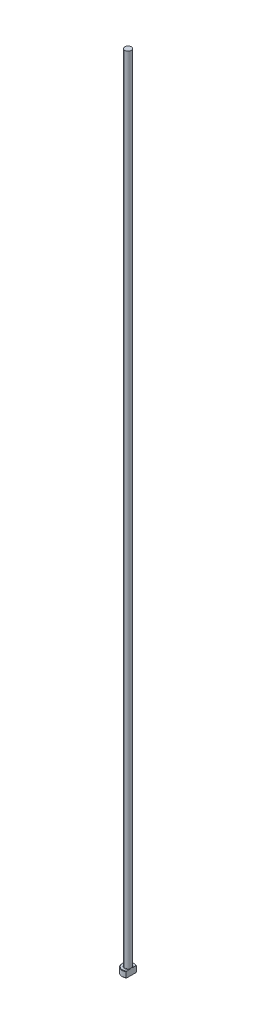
ISO-10303-21;
HEADER;
FILE_DESCRIPTION(('STEP AP214'),'2;1');
FILE_NAME('part.step','',(''),(''),'','','');
FILE_SCHEMA(('AUTOMOTIVE_DESIGN { 1 0 10303 214 1 1 1 1 }'));
ENDSEC;
DATA;
#1=APPLICATION_CONTEXT('core data for automotive mechanical design processes');
#2=APPLICATION_PROTOCOL_DEFINITION('international standard','automotive_design',2000,#1);
#3=PRODUCT_CONTEXT('',#1,'mechanical');
#4=PRODUCT('Part','Part','',(#3));
#5=PRODUCT_RELATED_PRODUCT_CATEGORY('part','',(#4));
#6=PRODUCT_DEFINITION_FORMATION('','',#4);
#7=PRODUCT_DEFINITION_CONTEXT('part definition',#1,'design');
#8=PRODUCT_DEFINITION('design','',#6,#7);
#9=PRODUCT_DEFINITION_SHAPE('','',#8);
#10=(LENGTH_UNIT() NAMED_UNIT(*) SI_UNIT(.MILLI.,.METRE.));
#11=(NAMED_UNIT(*) PLANE_ANGLE_UNIT() SI_UNIT($,.RADIAN.));
#12=(NAMED_UNIT(*) SI_UNIT($,.STERADIAN.) SOLID_ANGLE_UNIT());
#13=UNCERTAINTY_MEASURE_WITH_UNIT(LENGTH_MEASURE(1.E-05),#10,'distance_accuracy_value','');
#14=(GEOMETRIC_REPRESENTATION_CONTEXT(3) GLOBAL_UNCERTAINTY_ASSIGNED_CONTEXT((#13)) GLOBAL_UNIT_ASSIGNED_CONTEXT((#10,
#11,#12)) REPRESENTATION_CONTEXT('',''));
#15=CARTESIAN_POINT('',(0.,0.,0.));
#16=DIRECTION('',(0.,0.,1.));
#17=DIRECTION('',(1.,0.,0.));
#18=AXIS2_PLACEMENT_3D('',#15,#16,#17);
#19=CARTESIAN_POINT('',(0.,0.,0.));
#20=DIRECTION('',(0.,-1.,0.));
#21=DIRECTION('',(0.,0.,-1.));
#22=AXIS2_PLACEMENT_3D('',#19,#20,#21);
#23=PLANE('',#22);
#24=CARTESIAN_POINT('',(0.,0.,0.));
#25=DIRECTION('',(0.,-1.,0.));
#26=DIRECTION('',(0.,0.,-1.));
#27=AXIS2_PLACEMENT_3D('',#24,#25,#26);
#28=CIRCLE('',#27,2.79999999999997);
#29=CARTESIAN_POINT('',(1.59999999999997,0.,2.29782505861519));
#30=VERTEX_POINT('',#29);
#31=CARTESIAN_POINT('',(1.59999999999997,0.,-2.29782505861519));
#32=VERTEX_POINT('',#31);
#33=EDGE_CURVE('E98',#30,#32,#28,.T.);
#34=ORIENTED_EDGE('',*,*,#33,.T.);
#35=DIRECTION('',(0.,0.,1.));
#36=VECTOR('',#35,1.);
#37=CARTESIAN_POINT('',(1.59999999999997,0.,-2.53771550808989));
#38=LINE('',#37,#36);
#39=EDGE_CURVE('E83',#32,#30,#38,.T.);
#40=ORIENTED_EDGE('',*,*,#39,.T.);
#41=EDGE_LOOP('',(#34,#40));
#42=FACE_BOUND('',#41,.T.);
#43=ADVANCED_FACE('F32',(#42),#23,.T.);
#44=CARTESIAN_POINT('',(0.,259.958771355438,0.));
#45=DIRECTION('',(0.,1.,0.));
#46=DIRECTION('',(0.,0.,1.));
#47=AXIS2_PLACEMENT_3D('',#44,#45,#46);
#48=CYLINDRICAL_SURFACE('',#47,2.99999999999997);
#49=CARTESIAN_POINT('',(0.,2.80000000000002,0.));
#50=DIRECTION('',(0.,1.,0.));
#51=DIRECTION('',(0.,0.,1.));
#52=AXIS2_PLACEMENT_3D('',#49,#50,#51);
#53=CIRCLE('',#52,2.99999999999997);
#54=CARTESIAN_POINT('',(1.59999999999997,2.80000000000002,2.53771550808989));
#55=VERTEX_POINT('',#54);
#56=CARTESIAN_POINT('',(1.59999999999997,2.80000000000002,-2.53771550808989));
#57=VERTEX_POINT('',#56);
#58=EDGE_CURVE('E104',#55,#57,#53,.F.);
#59=ORIENTED_EDGE('',*,*,#58,.T.);
#60=DIRECTION('',(0.,-1.,0.));
#61=VECTOR('',#60,1.);
#62=CARTESIAN_POINT('',(1.59999999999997,400.,-2.53771550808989));
#63=LINE('',#62,#61);
#64=CARTESIAN_POINT('',(1.59999999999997,0.199999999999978,-2.53771550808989));
#65=VERTEX_POINT('',#64);
#66=EDGE_CURVE('E183',#57,#65,#63,.T.);
#67=ORIENTED_EDGE('',*,*,#66,.T.);
#68=CARTESIAN_POINT('',(0.,0.199999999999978,0.));
#69=DIRECTION('',(0.,-1.,0.));
#70=DIRECTION('',(0.,0.,-1.));
#71=AXIS2_PLACEMENT_3D('',#68,#69,#70);
#72=CIRCLE('',#71,2.99999999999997);
#73=CARTESIAN_POINT('',(1.59999999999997,0.199999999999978,2.53771550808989));
#74=VERTEX_POINT('',#73);
#75=EDGE_CURVE('E100',#65,#74,#72,.F.);
#76=ORIENTED_EDGE('',*,*,#75,.T.);
#77=DIRECTION('',(0.,-1.,0.));
#78=VECTOR('',#77,1.);
#79=CARTESIAN_POINT('',(1.59999999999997,400.,2.53771550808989));
#80=LINE('',#79,#78);
#81=EDGE_CURVE('E93',#55,#74,#80,.T.);
#82=ORIENTED_EDGE('',*,*,#81,.F.);
#83=EDGE_LOOP('',(#59,#67,#76,#82));
#84=FACE_BOUND('',#83,.T.);
#85=ADVANCED_FACE('F158',(#84),#48,.T.);
#86=CARTESIAN_POINT('',(-2.99999999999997,3.,0.));
#87=DIRECTION('',(0.,1.,0.));
#88=DIRECTION('',(0.,0.,1.));
#89=AXIS2_PLACEMENT_3D('',#86,#87,#88);
#90=PLANE('',#89);
#91=CARTESIAN_POINT('',(0.,3.,0.));
#92=DIRECTION('',(0.,1.,0.));
#93=DIRECTION('',(0.,0.,1.));
#94=AXIS2_PLACEMENT_3D('',#91,#92,#93);
#95=CIRCLE('',#94,2.80000000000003);
#96=CARTESIAN_POINT('',(1.59999999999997,3.,-2.29782505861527));
#97=VERTEX_POINT('',#96);
#98=CARTESIAN_POINT('',(1.59999999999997,3.,2.29782505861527));
#99=VERTEX_POINT('',#98);
#100=EDGE_CURVE('E178',#97,#99,#95,.T.);
#101=ORIENTED_EDGE('',*,*,#100,.T.);
#102=DIRECTION('',(0.,0.,-1.));
#103=VECTOR('',#102,1.);
#104=CARTESIAN_POINT('',(1.59999999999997,3.,0.));
#105=LINE('',#104,#103);
#106=CARTESIAN_POINT('',(1.59999999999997,2.99999999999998,0.824621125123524));
#107=VERTEX_POINT('',#106);
#108=EDGE_CURVE('E57',#99,#107,#105,.T.);
#109=ORIENTED_EDGE('',*,*,#108,.T.);
#110=CARTESIAN_POINT('',(0.,3.,0.));
#111=DIRECTION('',(0.,1.,0.));
#112=DIRECTION('',(0.,0.,1.));
#113=AXIS2_PLACEMENT_3D('',#110,#111,#112);
#114=CIRCLE('',#113,1.79999999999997);
#115=CARTESIAN_POINT('',(1.59999999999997,2.99999999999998,-0.824621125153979));
#116=VERTEX_POINT('',#115);
#117=EDGE_CURVE('E107',#107,#116,#114,.F.);
#118=ORIENTED_EDGE('',*,*,#117,.T.);
#119=EDGE_CURVE('E136',#116,#97,#105,.T.);
#120=ORIENTED_EDGE('',*,*,#119,.T.);
#121=EDGE_LOOP('',(#101,#109,#118,#120));
#122=FACE_BOUND('',#121,.T.);
#123=ADVANCED_FACE('F147',(#122),#90,.T.);
#124=CARTESIAN_POINT('',(0.,3.,0.));
#125=DIRECTION('',(0.,-1.,0.));
#126=DIRECTION('',(0.,0.,-1.));
#127=AXIS2_PLACEMENT_3D('',#124,#125,#126);
#128=CONICAL_SURFACE('',#127,2.80000000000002,0.785398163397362);
#129=ORIENTED_EDGE('',*,*,#58,.F.);
#130=CARTESIAN_POINT('',(1.59999999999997,-0.010183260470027,5.58553753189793));
#131=CARTESIAN_POINT('',(1.59999999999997,0.0972362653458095,5.47379440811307));
#132=CARTESIAN_POINT('',(1.59999999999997,0.204532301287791,5.36193239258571));
#133=CARTESIAN_POINT('',(1.59999999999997,0.418819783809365,5.13791519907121));
#134=CARTESIAN_POINT('',(1.59999999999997,0.525811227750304,5.02576001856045));
#135=CARTESIAN_POINT('',(1.59999999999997,0.846303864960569,4.68870684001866));
#136=CARTESIAN_POINT('',(1.59999999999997,1.05925853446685,4.46328850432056));
#137=CARTESIAN_POINT('',(1.59999999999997,1.48118306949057,4.01229981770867));
#138=CARTESIAN_POINT('',(1.59999999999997,1.69017139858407,3.78674682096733));
#139=CARTESIAN_POINT('',(1.59999999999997,2.00096196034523,3.44598591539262));
#140=CARTESIAN_POINT('',(1.59999999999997,2.10410381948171,3.33200088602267));
#141=CARTESIAN_POINT('',(1.59999999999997,2.30919104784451,3.10296070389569));
#142=CARTESIAN_POINT('',(1.59999999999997,2.411136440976,2.98790557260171));
#143=CARTESIAN_POINT('',(1.59999999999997,2.58757545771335,2.78593338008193));
#144=CARTESIAN_POINT('',(1.59999999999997,2.66243160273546,2.69933337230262));
#145=CARTESIAN_POINT('',(1.59999999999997,2.81098408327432,2.52513170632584));
#146=CARTESIAN_POINT('',(1.59999999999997,2.88468033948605,2.43752998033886));
#147=CARTESIAN_POINT('',(1.59999999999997,3.03092909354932,2.26058626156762));
#148=CARTESIAN_POINT('',(1.59999999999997,3.1034734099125,2.17123748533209));
#149=CARTESIAN_POINT('',(1.59999999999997,3.24645363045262,1.99088530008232));
#150=CARTESIAN_POINT('',(1.59999999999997,3.31688989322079,1.89988217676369));
#151=CARTESIAN_POINT('',(1.59999999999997,3.45543929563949,1.71486621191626));
#152=CARTESIAN_POINT('',(1.59999999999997,3.52352676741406,1.62083402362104));
#153=CARTESIAN_POINT('',(1.59999999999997,3.65543930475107,1.42966446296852));
#154=CARTESIAN_POINT('',(1.59999999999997,3.7192606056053,1.33252445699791));
#155=CARTESIAN_POINT('',(1.59999999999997,3.84005824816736,1.13468126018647));
#156=CARTESIAN_POINT('',(1.59999999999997,3.89706669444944,1.0339979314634));
#157=CARTESIAN_POINT('',(1.59999999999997,4.0008785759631,0.827509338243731));
#158=CARTESIAN_POINT('',(1.59999999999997,4.04770238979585,0.721714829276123));
#159=CARTESIAN_POINT('',(1.59999999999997,4.10597629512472,0.558809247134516));
#160=CARTESIAN_POINT('',(1.59999999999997,4.12339902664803,0.503846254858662));
#161=CARTESIAN_POINT('',(1.59999999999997,4.15340775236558,0.392598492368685));
#162=CARTESIAN_POINT('',(1.59999999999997,4.16599453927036,0.336313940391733));
#163=CARTESIAN_POINT('',(1.59999999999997,4.18546795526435,0.223146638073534));
#164=CARTESIAN_POINT('',(1.59999999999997,4.1923931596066,0.166270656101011));
#165=CARTESIAN_POINT('',(1.59999999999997,4.20016451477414,0.0521012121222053));
#166=CARTESIAN_POINT('',(1.59999999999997,4.20101133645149,-0.0051922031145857));
#167=CARTESIAN_POINT('',(1.59999999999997,4.19655603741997,-0.119606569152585));
#168=CARTESIAN_POINT('',(1.59999999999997,4.19124611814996,-0.176727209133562));
#169=CARTESIAN_POINT('',(1.59999999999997,4.17487728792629,-0.290132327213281));
#170=CARTESIAN_POINT('',(1.59999999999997,4.16381718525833,-0.346416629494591));
#171=CARTESIAN_POINT('',(1.59999999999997,4.13658168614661,-0.458175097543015));
#172=CARTESIAN_POINT('',(1.59999999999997,4.12036718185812,-0.513639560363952));
#173=CARTESIAN_POINT('',(1.59999999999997,4.08371568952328,-0.623133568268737));
#174=CARTESIAN_POINT('',(1.59999999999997,4.0632786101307,-0.677163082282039));
#175=CARTESIAN_POINT('',(1.59999999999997,4.01384079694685,-0.796206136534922));
#176=CARTESIAN_POINT('',(1.59999999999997,3.98395404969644,-0.860848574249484));
#177=CARTESIAN_POINT('',(1.59999999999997,3.9202487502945,-0.988182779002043));
#178=CARTESIAN_POINT('',(1.59999999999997,3.88642788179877,-1.0508733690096));
#179=CARTESIAN_POINT('',(1.59999999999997,3.81575061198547,-1.17466308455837));
#180=CARTESIAN_POINT('',(1.59999999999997,3.7788885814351,-1.23575897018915));
#181=CARTESIAN_POINT('',(1.59999999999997,3.70287361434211,-1.35651466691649));
#182=CARTESIAN_POINT('',(1.59999999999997,3.66372022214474,-1.4161741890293));
#183=CARTESIAN_POINT('',(1.59999999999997,3.54280392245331,-1.59458184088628));
#184=CARTESIAN_POINT('',(1.59999999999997,3.45833719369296,-1.71149244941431));
#185=CARTESIAN_POINT('',(1.59999999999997,3.2850848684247,-1.94177313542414));
#186=CARTESIAN_POINT('',(1.59999999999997,3.19630496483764,-2.05514757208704));
#187=CARTESIAN_POINT('',(1.59999999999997,2.98139222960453,-2.32229937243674));
#188=CARTESIAN_POINT('',(1.59999999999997,2.85392433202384,-2.47499901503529));
#189=CARTESIAN_POINT('',(1.59999999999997,2.5955750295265,-2.77749164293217));
#190=CARTESIAN_POINT('',(1.59999999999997,2.46469312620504,-2.92728419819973));
#191=CARTESIAN_POINT('',(1.59999999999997,2.20054459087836,-3.22502658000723));
#192=CARTESIAN_POINT('',(1.59999999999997,2.0672756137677,-3.37297432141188));
#193=CARTESIAN_POINT('',(1.59999999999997,1.79919464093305,-3.66744344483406));
#194=CARTESIAN_POINT('',(1.59999999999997,1.66438274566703,-3.81396491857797));
#195=CARTESIAN_POINT('',(1.59999999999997,1.40205824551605,-4.09689102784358));
#196=CARTESIAN_POINT('',(1.59999999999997,1.2746130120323,-4.23335821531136));
#197=CARTESIAN_POINT('',(1.59999999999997,1.01897493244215,-4.50559511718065));
#198=CARTESIAN_POINT('',(1.59999999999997,0.890782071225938,-4.64136481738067));
#199=CARTESIAN_POINT('',(1.59999999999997,0.634049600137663,-4.91211710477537));
#200=CARTESIAN_POINT('',(1.59999999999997,0.505511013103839,-5.04710066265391));
#201=CARTESIAN_POINT('',(1.59999999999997,0.247978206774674,-5.31662434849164));
#202=CARTESIAN_POINT('',(1.59999999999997,0.118984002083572,-5.45116449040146));
#203=CARTESIAN_POINT('',(1.59999999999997,-0.0101832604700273,-5.58553753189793));
#204=B_SPLINE_CURVE_WITH_KNOTS('',3,(#130,#131,#132,#133,#134,#135,#136,#137,#138,#139,#140,
#141,#142,#143,#144,#145,#146,#147,#148,#149,#150,#151,#152,#153,#154,#155,#156,#157,#158,#159,
#160,#161,#162,#163,#164,#165,#166,#167,#168,#169,#170,#171,#172,#173,#174,#175,#176,#177,#178,
#179,#180,#181,#182,#183,#184,#185,#186,#187,#188,#189,#190,#191,#192,#193,#194,#195,#196,#197,
#198,#199,#200,#201,#202,#203),.UNSPECIFIED.,.F.,.F.,(4,2,2,2,2,2,2,2,2,2,2,2,2,2,2,2,2,2,2,2,2,
2,2,2,2,2,2,2,2,2,2,2,2,2,2,2,4),(0.,0.465004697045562,0.930013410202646,1.86031116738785,
2.78275396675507,3.24391793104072,3.70507266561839,4.04847005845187,4.39189082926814,
4.73714054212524,5.08233118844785,5.43053718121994,5.7790465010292,6.12584271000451,
6.47193849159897,6.64473721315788,6.81750759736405,6.98909076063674,7.16065498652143,
7.33243676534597,7.50425415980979,7.67740760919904,7.85056480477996,8.0640331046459,
8.27762773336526,8.49162700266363,8.70566897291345,9.13816403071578,9.57010297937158,
10.166739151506,10.7634629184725,11.3608091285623,11.9581166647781,12.5182829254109,
13.0784605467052,13.6376414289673,14.1968045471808),.UNSPECIFIED.);
#205=EDGE_CURVE('E135',#55,#99,#204,.T.);
#206=ORIENTED_EDGE('',*,*,#205,.T.);
#207=ORIENTED_EDGE('',*,*,#100,.F.);
#208=EDGE_CURVE('E127',#97,#57,#204,.T.);
#209=ORIENTED_EDGE('',*,*,#208,.T.);
#210=EDGE_LOOP('',(#129,#206,#207,#209));
#211=FACE_BOUND('',#210,.T.);
#212=ADVANCED_FACE('F143',(#211),#128,.T.);
#213=CARTESIAN_POINT('',(0.,0.199999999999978,0.));
#214=DIRECTION('',(0.,1.,0.));
#215=DIRECTION('',(0.,0.,1.));
#216=AXIS2_PLACEMENT_3D('',#213,#214,#215);
#217=CONICAL_SURFACE('',#216,2.99999999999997,0.7853981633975);
#218=ORIENTED_EDGE('',*,*,#75,.F.);
#219=CARTESIAN_POINT('',(1.59999999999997,3.01018326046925,-5.58553753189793));
#220=CARTESIAN_POINT('',(1.59999999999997,2.90276373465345,-5.47379440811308));
#221=CARTESIAN_POINT('',(1.59999999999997,2.79546769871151,-5.36193239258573));
#222=CARTESIAN_POINT('',(1.59999999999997,2.58118021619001,-5.13791519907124));
#223=CARTESIAN_POINT('',(1.59999999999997,2.47418877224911,-5.02576001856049));
#224=CARTESIAN_POINT('',(1.59999999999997,2.15369613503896,-4.68870684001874));
#225=CARTESIAN_POINT('',(1.59999999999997,1.94074146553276,-4.46328850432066));
#226=CARTESIAN_POINT('',(1.59999999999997,1.51881693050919,-4.01229981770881));
#227=CARTESIAN_POINT('',(1.59999999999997,1.30982860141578,-3.7867468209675));
#228=CARTESIAN_POINT('',(1.59999999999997,0.99903803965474,-3.44598591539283));
#229=CARTESIAN_POINT('',(1.59999999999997,0.895896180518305,-3.33200088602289));
#230=CARTESIAN_POINT('',(1.59999999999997,0.690808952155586,-3.10296070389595));
#231=CARTESIAN_POINT('',(1.59999999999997,0.588863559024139,-2.98790557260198));
#232=CARTESIAN_POINT('',(1.59999999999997,0.412424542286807,-2.78593338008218));
#233=CARTESIAN_POINT('',(1.59999999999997,0.33756839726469,-2.69933337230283));
#234=CARTESIAN_POINT('',(1.59999999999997,0.189015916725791,-2.52513170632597));
#235=CARTESIAN_POINT('',(1.59999999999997,0.115319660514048,-2.43752998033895));
#236=CARTESIAN_POINT('',(1.59999999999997,-0.0309290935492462,-2.26058626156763));
#237=CARTESIAN_POINT('',(1.59999999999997,-0.103473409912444,-2.17123748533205));
#238=CARTESIAN_POINT('',(1.59999999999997,-0.246453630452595,-1.9908853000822));
#239=CARTESIAN_POINT('',(1.59999999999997,-0.316889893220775,-1.89988217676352));
#240=CARTESIAN_POINT('',(1.59999999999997,-0.4554392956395,-1.714866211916));
#241=CARTESIAN_POINT('',(1.59999999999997,-0.523526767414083,-1.62083402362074));
#242=CARTESIAN_POINT('',(1.59999999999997,-0.655439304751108,-1.42966446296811));
#243=CARTESIAN_POINT('',(1.59999999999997,-0.719260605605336,-1.33252445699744));
#244=CARTESIAN_POINT('',(1.59999999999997,-0.840058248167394,-1.13468126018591));
#245=CARTESIAN_POINT('',(1.59999999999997,-0.89706669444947,-1.03399793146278));
#246=CARTESIAN_POINT('',(1.59999999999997,-1.0008785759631,-0.827509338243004));
#247=CARTESIAN_POINT('',(1.59999999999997,-1.04770238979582,-0.72171482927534));
#248=CARTESIAN_POINT('',(1.59999999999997,-1.10597629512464,-0.558809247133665));
#249=CARTESIAN_POINT('',(1.59999999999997,-1.12339902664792,-0.5038462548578));
#250=CARTESIAN_POINT('',(1.59999999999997,-1.15340775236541,-0.392598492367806));
#251=CARTESIAN_POINT('',(1.59999999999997,-1.16599453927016,-0.336313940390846));
#252=CARTESIAN_POINT('',(1.59999999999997,-1.18546795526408,-0.223146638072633));
#253=CARTESIAN_POINT('',(1.59999999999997,-1.19239315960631,-0.166270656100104));
#254=CARTESIAN_POINT('',(1.59999999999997,-1.20016451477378,-0.0521012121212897));
#255=CARTESIAN_POINT('',(1.59999999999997,-1.2010113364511,0.00519220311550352));
#256=CARTESIAN_POINT('',(1.59999999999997,-1.19655603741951,0.1196065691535));
#257=CARTESIAN_POINT('',(1.59999999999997,-1.19124611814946,0.176727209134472));
#258=CARTESIAN_POINT('',(1.59999999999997,-1.17487728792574,0.29013232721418));
#259=CARTESIAN_POINT('',(1.59999999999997,-1.16381718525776,0.346416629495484));
#260=CARTESIAN_POINT('',(1.59999999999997,-1.136581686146,0.458175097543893));
#261=CARTESIAN_POINT('',(1.59999999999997,-1.12036718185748,0.513639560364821));
#262=CARTESIAN_POINT('',(1.59999999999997,-1.08371568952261,0.623133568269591));
#263=CARTESIAN_POINT('',(1.59999999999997,-1.06327861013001,0.677163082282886));
#264=CARTESIAN_POINT('',(1.59999999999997,-1.01384079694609,0.796206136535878));
#265=CARTESIAN_POINT('',(1.59999999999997,-0.983954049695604,0.860848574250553));
#266=CARTESIAN_POINT('',(1.59999999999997,-0.920248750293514,0.988182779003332));
#267=CARTESIAN_POINT('',(1.59999999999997,-0.886427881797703,1.050873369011));
#268=CARTESIAN_POINT('',(1.59999999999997,-0.815750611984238,1.17466308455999));
#269=CARTESIAN_POINT('',(1.59999999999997,-0.778888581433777,1.23575897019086));
#270=CARTESIAN_POINT('',(1.59999999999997,-0.702873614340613,1.35651466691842));
#271=CARTESIAN_POINT('',(1.59999999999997,-0.663720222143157,1.41617418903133));
#272=CARTESIAN_POINT('',(1.59999999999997,-0.542803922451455,1.59458184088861));
#273=CARTESIAN_POINT('',(1.59999999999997,-0.458337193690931,1.71149244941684));
#274=CARTESIAN_POINT('',(1.59999999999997,-0.285084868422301,1.94177313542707));
#275=CARTESIAN_POINT('',(1.59999999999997,-0.196304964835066,2.05514757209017));
#276=CARTESIAN_POINT('',(1.59999999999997,0.018607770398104,2.32229937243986));
#277=CARTESIAN_POINT('',(1.59999999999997,0.146075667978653,2.47499901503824));
#278=CARTESIAN_POINT('',(1.59999999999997,0.404424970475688,2.77749164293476));
#279=CARTESIAN_POINT('',(1.59999999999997,0.535306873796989,2.92728419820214));
#280=CARTESIAN_POINT('',(1.59999999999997,0.799455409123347,3.22502658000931));
#281=CARTESIAN_POINT('',(1.59999999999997,0.93272438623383,3.3729743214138));
#282=CARTESIAN_POINT('',(1.59999999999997,1.20080535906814,3.66744344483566));
#283=CARTESIAN_POINT('',(1.59999999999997,1.33561725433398,3.81396491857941));
#284=CARTESIAN_POINT('',(1.59999999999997,1.59794175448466,4.09689102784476));
#285=CARTESIAN_POINT('',(1.59999999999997,1.72538698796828,4.23335821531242));
#286=CARTESIAN_POINT('',(1.59999999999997,1.98102506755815,4.5055951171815));
#287=CARTESIAN_POINT('',(1.59999999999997,2.10921792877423,4.6413648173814));
#288=CARTESIAN_POINT('',(1.59999999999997,2.36595039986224,4.91211710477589));
#289=CARTESIAN_POINT('',(1.59999999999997,2.49448898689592,5.04710066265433));
#290=CARTESIAN_POINT('',(1.59999999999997,2.75202179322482,5.31662434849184));
#291=CARTESIAN_POINT('',(1.59999999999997,2.88101599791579,5.45116449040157));
#292=CARTESIAN_POINT('',(1.59999999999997,3.01018326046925,5.58553753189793));
#293=B_SPLINE_CURVE_WITH_KNOTS('',3,(#219,#220,#221,#222,#223,#224,#225,#226,#227,#228,#229,
#230,#231,#232,#233,#234,#235,#236,#237,#238,#239,#240,#241,#242,#243,#244,#245,#246,#247,#248,
#249,#250,#251,#252,#253,#254,#255,#256,#257,#258,#259,#260,#261,#262,#263,#264,#265,#266,#267,
#268,#269,#270,#271,#272,#273,#274,#275,#276,#277,#278,#279,#280,#281,#282,#283,#284,#285,#286,
#287,#288,#289,#290,#291,#292),.UNSPECIFIED.,.F.,.F.,(4,2,2,2,2,2,2,2,2,2,2,2,2,2,2,2,2,2,2,2,2,
2,2,2,2,2,2,2,2,2,2,2,2,2,2,2,4),(0.,0.465004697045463,0.930013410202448,1.86031116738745,
2.78275396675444,3.24391793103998,3.70507266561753,4.04847005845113,4.39189082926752,
4.73714054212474,5.08233118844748,5.43053718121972,5.77904650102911,6.12584271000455,
6.47193849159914,6.64473721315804,6.81750759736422,6.98909076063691,7.16065498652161,
7.33243676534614,7.50425415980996,7.6774076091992,7.85056480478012,8.06403310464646,
8.27762773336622,8.49162700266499,8.70566897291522,9.13816403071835,9.57010297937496,
10.1667391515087,10.7634629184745,11.3608091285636,11.9581166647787,12.5182829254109,
13.0784605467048,13.6376414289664,14.1968045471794),.UNSPECIFIED.);
#294=EDGE_CURVE('E86',#65,#32,#293,.T.);
#295=ORIENTED_EDGE('',*,*,#294,.T.);
#296=ORIENTED_EDGE('',*,*,#33,.F.);
#297=EDGE_CURVE('E89',#30,#74,#293,.T.);
#298=ORIENTED_EDGE('',*,*,#297,.T.);
#299=EDGE_LOOP('',(#218,#295,#296,#298));
#300=FACE_BOUND('',#299,.T.);
#301=ADVANCED_FACE('F97',(#300),#217,.T.);
#302=CARTESIAN_POINT('',(0.,3.19999999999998,0.));
#303=DIRECTION('',(0.,1.,0.));
#304=DIRECTION('',(0.,0.,1.));
#305=AXIS2_PLACEMENT_3D('',#302,#303,#304);
#306=TOROIDAL_SURFACE('',#305,1.79999999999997,0.2);
#307=CARTESIAN_POINT('',(1.59999999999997,3.19999999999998,0.));
#308=CARTESIAN_POINT('',(1.59999999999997,3.20000050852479,4.54943754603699E-11));
#309=CARTESIAN_POINT('',(1.59999999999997,3.20000101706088,-1.26961255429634E-07));
#310=CARTESIAN_POINT('',(1.59999999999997,3.20000198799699,-5.15663776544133E-07));
#311=CARTESIAN_POINT('',(1.59999999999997,3.20000244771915,-7.82570768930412E-07));
#312=CARTESIAN_POINT('',(1.59999999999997,3.20000337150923,-1.42107859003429E-06));
#313=CARTESIAN_POINT('',(1.59999999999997,3.2000038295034,-1.8013897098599E-06));
#314=CARTESIAN_POINT('',(1.59999999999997,3.20000468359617,-2.61302269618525E-06));
#315=CARTESIAN_POINT('',(1.59999999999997,3.20000508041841,-3.04362154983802E-06));
#316=CARTESIAN_POINT('',(1.59999999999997,3.20000644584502,-4.61783099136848E-06));
#317=CARTESIAN_POINT('',(1.59999999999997,3.2000073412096,-5.82629496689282E-06));
#318=CARTESIAN_POINT('',(1.59999999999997,3.20000890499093,-8.29532278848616E-06));
#319=CARTESIAN_POINT('',(1.59999999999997,3.2000095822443,-9.55059430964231E-06));
#320=CARTESIAN_POINT('',(1.59999999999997,3.2000122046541,-1.4561779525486E-05));
#321=CARTESIAN_POINT('',(1.59999999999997,3.20001402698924,-1.8385925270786E-05));
#322=CARTESIAN_POINT('',(1.59999999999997,3.20001693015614,-2.58398167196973E-05));
#323=CARTESIAN_POINT('',(1.59999999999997,3.20001806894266,-2.9447492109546E-05));
#324=CARTESIAN_POINT('',(1.59999999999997,3.20002303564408,-4.5117550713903E-05));
#325=CARTESIAN_POINT('',(1.59999999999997,3.20002690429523,-5.71577768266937E-05));
#326=CARTESIAN_POINT('',(1.59999999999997,3.20003298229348,-7.95113108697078E-05));
#327=CARTESIAN_POINT('',(1.59999999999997,3.20003536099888,-8.97762976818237E-05));
#328=CARTESIAN_POINT('',(1.59999999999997,3.20005453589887,-0.000165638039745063));
#329=CARTESIAN_POINT('',(1.59999999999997,3.20007944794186,-0.000228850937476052));
#330=CARTESIAN_POINT('',(1.59999999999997,3.20017354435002,-0.000476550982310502));
#331=CARTESIAN_POINT('',(1.59999999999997,3.20023667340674,-0.000662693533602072));
#332=CARTESIAN_POINT('',(1.59999999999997,3.2004875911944,-0.00139193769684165));
#333=CARTESIAN_POINT('',(1.59999999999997,3.20068172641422,-0.00193335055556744));
#334=CARTESIAN_POINT('',(1.59999999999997,3.20147743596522,-0.00416279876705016));
#335=CARTESIAN_POINT('',(1.59999999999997,3.20207183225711,-0.00585269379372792));
#336=CARTESIAN_POINT('',(1.59999999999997,3.2087643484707,-0.0248666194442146));
#337=CARTESIAN_POINT('',(1.59999999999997,3.21490191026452,-0.0421807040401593));
#338=CARTESIAN_POINT('',(1.59999999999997,3.22687857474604,-0.0761752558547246));
#339=CARTESIAN_POINT('',(1.59999999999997,3.23272018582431,-0.092854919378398));
#340=CARTESIAN_POINT('',(1.59999999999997,3.2450295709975,-0.128242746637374));
#341=CARTESIAN_POINT('',(1.59999999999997,3.25148835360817,-0.146954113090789));
#342=CARTESIAN_POINT('',(1.59999999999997,3.26432449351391,-0.18462192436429));
#343=CARTESIAN_POINT('',(1.59999999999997,3.27070030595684,-0.203578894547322));
#344=CARTESIAN_POINT('',(1.59999999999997,3.2861130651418,-0.250227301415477));
#345=CARTESIAN_POINT('',(1.59999999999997,3.29503653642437,-0.277956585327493));
#346=CARTESIAN_POINT('',(1.59999999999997,3.31206503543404,-0.332930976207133));
#347=CARTESIAN_POINT('',(1.59999999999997,3.32018465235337,-0.360171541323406));
#348=CARTESIAN_POINT('',(1.59999999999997,3.33730366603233,-0.420681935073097));
#349=CARTESIAN_POINT('',(1.59999999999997,3.34612355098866,-0.454003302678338));
#350=CARTESIAN_POINT('',(1.59999999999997,3.36232017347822,-0.521270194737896));
#351=CARTESIAN_POINT('',(1.59999999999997,3.36968538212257,-0.555218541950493));
#352=CARTESIAN_POINT('',(1.59999999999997,3.38286655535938,-0.625950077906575));
#353=CARTESIAN_POINT('',(1.59999999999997,3.3885334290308,-0.6627618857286));
#354=CARTESIAN_POINT('',(1.59999999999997,3.3967820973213,-0.736647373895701));
#355=CARTESIAN_POINT('',(1.59999999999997,3.39937308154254,-0.773719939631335));
#356=CARTESIAN_POINT('',(1.59999999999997,3.40041949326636,-0.847207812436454));
#357=CARTESIAN_POINT('',(1.59999999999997,3.39895641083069,-0.88362147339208));
#358=CARTESIAN_POINT('',(1.59999999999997,3.39061157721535,-0.955314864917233));
#359=CARTESIAN_POINT('',(1.59999999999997,3.3838299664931,-0.990603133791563));
#360=CARTESIAN_POINT('',(1.59999999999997,3.36933665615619,-1.03710764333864));
#361=CARTESIAN_POINT('',(1.59999999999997,3.36495855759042,-1.04936206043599));
#362=CARTESIAN_POINT('',(1.59999999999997,3.35498242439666,-1.07342013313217));
#363=CARTESIAN_POINT('',(1.59999999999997,3.34938064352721,-1.08522227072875));
#364=CARTESIAN_POINT('',(1.59999999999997,3.33671785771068,-1.10815425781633));
#365=CARTESIAN_POINT('',(1.59999999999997,3.32964542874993,-1.11927790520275));
#366=CARTESIAN_POINT('',(1.59999999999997,3.31385032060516,-1.14028316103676));
#367=CARTESIAN_POINT('',(1.59999999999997,3.30513251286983,-1.15016829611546));
#368=CARTESIAN_POINT('',(1.59999999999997,3.2893714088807,-1.16476986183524));
#369=CARTESIAN_POINT('',(1.59999999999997,3.28286385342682,-1.17006219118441));
#370=CARTESIAN_POINT('',(1.59999999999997,3.26911414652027,-1.179603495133));
#371=CARTESIAN_POINT('',(1.59999999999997,3.2618722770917,-1.18385286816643));
#372=CARTESIAN_POINT('',(1.59999999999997,3.24665711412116,-1.19105502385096));
#373=CARTESIAN_POINT('',(1.59999999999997,3.23867649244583,-1.19399264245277));
#374=CARTESIAN_POINT('',(1.59999999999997,3.22228884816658,-1.19821047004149));
#375=CARTESIAN_POINT('',(1.59999999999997,3.21388246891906,-1.19949310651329));
#376=CARTESIAN_POINT('',(1.59999999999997,3.19822871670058,-1.20020429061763));
#377=CARTESIAN_POINT('',(1.59999999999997,3.19099166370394,-1.19987658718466));
#378=CARTESIAN_POINT('',(1.59999999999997,3.1766911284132,-1.19794337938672));
#379=CARTESIAN_POINT('',(1.59999999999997,3.16962767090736,-1.19633769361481));
#380=CARTESIAN_POINT('',(1.59999999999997,3.15619326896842,-1.19208069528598));
#381=CARTESIAN_POINT('',(1.59999999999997,3.14980538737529,-1.18948176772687));
#382=CARTESIAN_POINT('',(1.59999999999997,3.13747056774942,-1.18339991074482));
#383=CARTESIAN_POINT('',(1.59999999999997,3.13152374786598,-1.17991674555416));
#384=CARTESIAN_POINT('',(1.59999999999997,3.11701630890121,-1.17013377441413));
#385=CARTESIAN_POINT('',(1.59999999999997,3.10879365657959,-1.16333250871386));
#386=CARTESIAN_POINT('',(1.59999999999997,3.09352344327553,-1.14851362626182));
#387=CARTESIAN_POINT('',(1.59999999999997,3.08647946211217,-1.14049244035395));
#388=CARTESIAN_POINT('',(1.59999999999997,3.06978612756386,-1.11881325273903));
#389=CARTESIAN_POINT('',(1.59999999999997,3.06093454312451,-1.10454463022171));
#390=CARTESIAN_POINT('',(1.59999999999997,3.045486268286,-1.07488732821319));
#391=CARTESIAN_POINT('',(1.59999999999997,3.03889016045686,-1.05949836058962));
#392=CARTESIAN_POINT('',(1.59999999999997,3.02310414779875,-1.01585357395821));
#393=CARTESIAN_POINT('',(1.59999999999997,3.01588276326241,-0.98689334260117));
#394=CARTESIAN_POINT('',(1.59999999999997,3.00554634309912,-0.927965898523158));
#395=CARTESIAN_POINT('',(1.59999999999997,3.00248580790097,-0.89799049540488));
#396=CARTESIAN_POINT('',(1.59999999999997,2.99950013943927,-0.836442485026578));
#397=CARTESIAN_POINT('',(1.59999999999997,2.99973474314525,-0.804863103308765));
#398=CARTESIAN_POINT('',(1.59999999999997,3.00289974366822,-0.74177978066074));
#399=CARTESIAN_POINT('',(1.59999999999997,3.00583724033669,-0.710276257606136));
#400=CARTESIAN_POINT('',(1.59999999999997,3.01360294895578,-0.649223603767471));
#401=CARTESIAN_POINT('',(1.59999999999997,3.01832173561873,-0.61965999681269));
#402=CARTESIAN_POINT('',(1.59999999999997,3.02922114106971,-0.561003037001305));
#403=CARTESIAN_POINT('',(1.59999999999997,3.03539231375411,-0.531907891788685));
#404=CARTESIAN_POINT('',(1.59999999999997,3.05057454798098,-0.466833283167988));
#405=CARTESIAN_POINT('',(1.59999999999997,3.05991050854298,-0.430930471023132));
#406=CARTESIAN_POINT('',(1.59999999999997,3.08015300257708,-0.358646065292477));
#407=CARTESIAN_POINT('',(1.59999999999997,3.09109187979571,-0.322273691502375));
#408=CARTESIAN_POINT('',(1.59999999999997,3.11028869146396,-0.261379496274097));
#409=CARTESIAN_POINT('',(1.59999999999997,3.1182898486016,-0.236775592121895));
#410=CARTESIAN_POINT('',(1.59999999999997,3.13453271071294,-0.18793162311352));
#411=CARTESIAN_POINT('',(1.59999999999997,3.14277104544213,-0.163690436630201));
#412=CARTESIAN_POINT('',(1.59999999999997,3.158545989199,-0.117881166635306));
#413=CARTESIAN_POINT('',(1.59999999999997,3.16606272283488,-0.0963061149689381));
#414=CARTESIAN_POINT('',(1.59999999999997,3.18151152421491,-0.0523381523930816));
#415=CARTESIAN_POINT('',(1.59999999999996,3.18944823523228,-0.0299467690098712));
#416=CARTESIAN_POINT('',(1.59999999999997,3.19792848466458,-0.0058516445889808));
#417=CARTESIAN_POINT('',(1.59999999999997,3.19852328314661,-0.00416072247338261));
#418=CARTESIAN_POINT('',(1.59999999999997,3.19931909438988,-0.00193103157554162));
#419=CARTESIAN_POINT('',(1.59999999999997,3.19951294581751,-0.00139040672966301));
#420=CARTESIAN_POINT('',(1.59999999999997,3.19976352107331,-0.000662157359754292));
#421=CARTESIAN_POINT('',(1.59999999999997,3.19982658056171,-0.000476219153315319));
#422=CARTESIAN_POINT('',(1.59999999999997,3.19992058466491,-0.000228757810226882));
#423=CARTESIAN_POINT('',(1.59999999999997,3.19994548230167,-0.000165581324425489));
#424=CARTESIAN_POINT('',(1.59999999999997,3.19996464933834,-8.97604211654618E-05));
#425=CARTESIAN_POINT('',(1.59999999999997,3.19996702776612,-7.94979693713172E-05));
#426=CARTESIAN_POINT('',(1.59999999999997,3.19997310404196,-5.71501112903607E-05));
#427=CARTESIAN_POINT('',(1.59999999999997,3.19997697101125,-4.51129589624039E-05));
#428=CARTESIAN_POINT('',(1.59999999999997,3.19998193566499,-2.94463390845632E-05));
#429=CARTESIAN_POINT('',(1.59999999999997,3.19998307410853,-2.58390376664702E-05));
#430=CARTESIAN_POINT('',(1.59999999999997,3.1999859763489,-1.83858674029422E-05));
#431=CARTESIAN_POINT('',(1.59999999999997,3.19998779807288,-1.45620535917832E-05));
#432=CARTESIAN_POINT('',(1.59999999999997,3.19999041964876,-9.55118975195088E-06));
#433=CARTESIAN_POINT('',(1.59999999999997,3.19999109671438,-8.29594696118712E-06));
#434=CARTESIAN_POINT('',(1.59999999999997,3.19999266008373,-5.82694057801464E-06));
#435=CARTESIAN_POINT('',(1.59999999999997,3.19999355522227,-4.61846686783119E-06));
#436=CARTESIAN_POINT('',(1.59999999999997,3.19999492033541,-3.04420143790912E-06));
#437=CARTESIAN_POINT('',(1.59999999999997,3.19999531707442,-2.61357770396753E-06));
#438=CARTESIAN_POINT('',(1.59999999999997,3.19999617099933,-1.80187998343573E-06));
#439=CARTESIAN_POINT('',(1.59999999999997,3.19999662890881,-1.4215287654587E-06));
#440=CARTESIAN_POINT('',(1.59999999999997,3.19999755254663,-7.8292447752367E-07));
#441=CARTESIAN_POINT('',(1.59999999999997,3.199998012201,-5.1596356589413E-07));
#442=CARTESIAN_POINT('',(1.59999999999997,3.19999898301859,-1.27129000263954E-07));
#443=CARTESIAN_POINT('',(1.59999999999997,3.19999949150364,-4.54918281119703E-11));
#444=CARTESIAN_POINT('',(1.59999999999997,3.19999999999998,0.));
#445=B_SPLINE_CURVE_WITH_KNOTS('',3,(#307,#308,#309,#310,#311,#312,#313,#314,#315,#316,#317,
#318,#319,#320,#321,#322,#323,#324,#325,#326,#327,#328,#329,#330,#331,#332,#333,#334,#335,#336,
#337,#338,#339,#340,#341,#342,#343,#344,#345,#346,#347,#348,#349,#350,#351,#352,#353,#354,#355,
#356,#357,#358,#359,#360,#361,#362,#363,#364,#365,#366,#367,#368,#369,#370,#371,#372,#373,#374,
#375,#376,#377,#378,#379,#380,#381,#382,#383,#384,#385,#386,#387,#388,#389,#390,#391,#392,#393,
#394,#395,#396,#397,#398,#399,#400,#401,#402,#403,#404,#405,#406,#407,#408,#409,#410,#411,#412,
#413,#414,#415,#416,#417,#418,#419,#420,#421,#422,#423,#424,#425,#426,#427,#428,#429,#430,#431,
#432,#433,#434,#435,#436,#437,#438,#439,#440,#441,#442,#443,#444),.UNSPECIFIED.,.T.,.F.,(4,2,2,
2,2,2,2,2,2,2,2,2,2,2,2,2,2,2,2,2,2,2,2,2,2,2,2,2,2,2,2,2,2,2,2,2,2,2,2,2,2,2,2,2,2,2,2,2,2,2,2,
2,2,2,2,2,2,2,2,2,2,2,2,2,2,2,2,2,4),(0.,1.52634300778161E-06,3.11406916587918E-06,
4.89195151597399E-06,6.64684989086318E-06,1.11381074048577E-05,1.54135914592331E-05,
2.80880177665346E-05,3.94249647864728E-05,7.7360103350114E-05,0.000108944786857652,
0.000312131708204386,0.00090234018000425,0.00262715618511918,0.00800204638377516,
0.0631063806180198,0.116126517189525,0.175509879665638,0.235510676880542,0.322894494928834,
0.408161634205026,0.511541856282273,0.615711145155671,0.727355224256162,0.838664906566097,
0.947753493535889,1.05483601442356,1.09382604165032,1.13293715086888,1.17236425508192,
1.21167640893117,1.23676182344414,1.26183763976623,1.28719627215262,1.31251766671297,
1.33413541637,1.35575623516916,1.37636641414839,1.39698209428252,1.42881268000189,
1.46073825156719,1.51082746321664,1.56092960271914,1.64997182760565,1.74016947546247,
1.83475408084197,1.92958784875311,2.01935385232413,2.10855142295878,2.21980473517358,
2.33373085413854,2.4113451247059,2.48815160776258,2.55669374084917,2.62795640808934,
2.63333459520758,2.63505690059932,2.63564646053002,2.63584953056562,2.63588110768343,
2.6359190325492,2.63593036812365,2.63594304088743,2.63594731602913,2.63595180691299,
2.63595356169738,2.63595533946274,2.63595692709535,2.63595845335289),.UNSPECIFIED.);
#446=CARTESIAN_POINT('',(1.59999999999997,3.19999999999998,0.));
#447=VERTEX_POINT('',#446);
#448=EDGE_CURVE('E11',#116,#447,#445,.T.);
#449=ORIENTED_EDGE('',*,*,#448,.F.);
#450=ORIENTED_EDGE('',*,*,#117,.F.);
#451=CARTESIAN_POINT('',(1.59999999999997,3.19999999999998,0.));
#452=CARTESIAN_POINT('',(1.59999999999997,3.19999949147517,-4.54943940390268E-11));
#453=CARTESIAN_POINT('',(1.59999999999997,3.19999898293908,1.26961255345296E-07));
#454=CARTESIAN_POINT('',(1.59999999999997,3.19999801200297,5.1566377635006E-07));
#455=CARTESIAN_POINT('',(1.59999999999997,3.19999755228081,7.82570768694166E-07));
#456=CARTESIAN_POINT('',(1.59999999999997,3.19999662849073,1.4210785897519E-06));
#457=CARTESIAN_POINT('',(1.59999999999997,3.19999617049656,1.80138970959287E-06));
#458=CARTESIAN_POINT('',(1.59999999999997,3.19999531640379,2.61302269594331E-06));
#459=CARTESIAN_POINT('',(1.59999999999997,3.19999491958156,3.04362154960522E-06));
#460=CARTESIAN_POINT('',(1.59999999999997,3.19999355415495,4.61783099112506E-06));
#461=CARTESIAN_POINT('',(1.59999999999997,3.19999265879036,5.82629496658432E-06));
#462=CARTESIAN_POINT('',(1.59999999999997,3.19999109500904,8.29532278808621E-06));
#463=CARTESIAN_POINT('',(1.59999999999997,3.19999041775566,9.55059430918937E-06));
#464=CARTESIAN_POINT('',(1.59999999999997,3.19998779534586,1.45617795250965E-05));
#465=CARTESIAN_POINT('',(1.59999999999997,3.19998597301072,1.83859252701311E-05));
#466=CARTESIAN_POINT('',(1.59999999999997,3.19998306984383,2.58398167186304E-05));
#467=CARTESIAN_POINT('',(1.59999999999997,3.1999819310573,2.94474921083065E-05));
#468=CARTESIAN_POINT('',(1.59999999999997,3.19997696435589,4.51175507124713E-05));
#469=CARTESIAN_POINT('',(1.59999999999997,3.19997309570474,5.7157776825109E-05));
#470=CARTESIAN_POINT('',(1.59999999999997,3.19996701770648,7.95113108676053E-05));
#471=CARTESIAN_POINT('',(1.59999999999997,3.19996463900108,8.9776297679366E-05));
#472=CARTESIAN_POINT('',(1.59999999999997,3.19994546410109,0.000165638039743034));
#473=CARTESIAN_POINT('',(1.59999999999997,3.1999205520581,0.000228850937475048));
#474=CARTESIAN_POINT('',(1.59999999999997,3.19982645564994,0.000476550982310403));
#475=CARTESIAN_POINT('',(1.59999999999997,3.19976332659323,0.000662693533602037));
#476=CARTESIAN_POINT('',(1.59999999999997,3.19951240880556,0.0013919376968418));
#477=CARTESIAN_POINT('',(1.59999999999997,3.19931827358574,0.0019333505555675));
#478=CARTESIAN_POINT('',(1.59999999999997,3.19852256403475,0.00416279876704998));
#479=CARTESIAN_POINT('',(1.59999999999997,3.19792816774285,0.00585269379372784));
#480=CARTESIAN_POINT('',(1.59999999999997,3.19123565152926,0.0248666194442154));
#481=CARTESIAN_POINT('',(1.59999999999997,3.18509808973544,0.0421807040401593));
#482=CARTESIAN_POINT('',(1.59999999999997,3.17312142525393,0.0761752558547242));
#483=CARTESIAN_POINT('',(1.59999999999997,3.16727981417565,0.0928549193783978));
#484=CARTESIAN_POINT('',(1.59999999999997,3.15497042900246,0.128242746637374));
#485=CARTESIAN_POINT('',(1.59999999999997,3.14851164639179,0.146954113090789));
#486=CARTESIAN_POINT('',(1.59999999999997,3.13567550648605,0.18462192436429));
#487=CARTESIAN_POINT('',(1.59999999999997,3.12929969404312,0.203578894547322));
#488=CARTESIAN_POINT('',(1.59999999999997,3.11388693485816,0.250227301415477));
#489=CARTESIAN_POINT('',(1.59999999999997,3.10496346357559,0.277956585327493));
#490=CARTESIAN_POINT('',(1.59999999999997,3.08793496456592,0.332930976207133));
#491=CARTESIAN_POINT('',(1.59999999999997,3.0798153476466,0.360171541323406));
#492=CARTESIAN_POINT('',(1.59999999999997,3.06269633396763,0.420681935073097));
#493=CARTESIAN_POINT('',(1.59999999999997,3.0538764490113,0.454003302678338));
#494=CARTESIAN_POINT('',(1.59999999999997,3.03767982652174,0.521270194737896));
#495=CARTESIAN_POINT('',(1.59999999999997,3.03031461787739,0.555218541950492));
#496=CARTESIAN_POINT('',(1.59999999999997,3.01713344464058,0.625950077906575));
#497=CARTESIAN_POINT('',(1.59999999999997,3.01146657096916,0.6627618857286));
#498=CARTESIAN_POINT('',(1.59999999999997,3.00321790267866,0.736647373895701));
#499=CARTESIAN_POINT('',(1.59999999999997,3.00062691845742,0.773719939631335));
#500=CARTESIAN_POINT('',(1.59999999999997,2.9995805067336,0.847207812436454));
#501=CARTESIAN_POINT('',(1.59999999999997,3.00104358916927,0.88362147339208));
#502=CARTESIAN_POINT('',(1.59999999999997,3.00938842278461,0.955314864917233));
#503=CARTESIAN_POINT('',(1.59999999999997,3.01617003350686,0.990603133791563));
#504=CARTESIAN_POINT('',(1.59999999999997,3.03066334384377,1.03710764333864));
#505=CARTESIAN_POINT('',(1.59999999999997,3.03504144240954,1.04936206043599));
#506=CARTESIAN_POINT('',(1.59999999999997,3.04501757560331,1.07342013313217));
#507=CARTESIAN_POINT('',(1.59999999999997,3.05061935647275,1.08522227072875));
#508=CARTESIAN_POINT('',(1.59999999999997,3.06328214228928,1.10815425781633));
#509=CARTESIAN_POINT('',(1.59999999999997,3.07035457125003,1.11927790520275));
#510=CARTESIAN_POINT('',(1.59999999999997,3.0861496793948,1.14028316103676));
#511=CARTESIAN_POINT('',(1.59999999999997,3.09486748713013,1.15016829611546));
#512=CARTESIAN_POINT('',(1.59999999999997,3.11062859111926,1.16476986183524));
#513=CARTESIAN_POINT('',(1.59999999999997,3.11713614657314,1.17006219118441));
#514=CARTESIAN_POINT('',(1.59999999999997,3.13088585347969,1.179603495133));
#515=CARTESIAN_POINT('',(1.59999999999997,3.13812772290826,1.18385286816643));
#516=CARTESIAN_POINT('',(1.59999999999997,3.1533428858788,1.19105502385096));
#517=CARTESIAN_POINT('',(1.59999999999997,3.16132350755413,1.19399264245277));
#518=CARTESIAN_POINT('',(1.59999999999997,3.17771115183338,1.19821047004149));
#519=CARTESIAN_POINT('',(1.59999999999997,3.1861175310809,1.19949310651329));
#520=CARTESIAN_POINT('',(1.59999999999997,3.20177128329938,1.20020429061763));
#521=CARTESIAN_POINT('',(1.59999999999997,3.20900833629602,1.19987658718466));
#522=CARTESIAN_POINT('',(1.59999999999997,3.22330887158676,1.19794337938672));
#523=CARTESIAN_POINT('',(1.59999999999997,3.2303723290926,1.19633769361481));
#524=CARTESIAN_POINT('',(1.59999999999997,3.24380673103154,1.19208069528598));
#525=CARTESIAN_POINT('',(1.59999999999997,3.25019461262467,1.18948176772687));
#526=CARTESIAN_POINT('',(1.59999999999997,3.26252943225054,1.18339991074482));
#527=CARTESIAN_POINT('',(1.59999999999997,3.26847625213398,1.17991674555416));
#528=CARTESIAN_POINT('',(1.59999999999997,3.28298369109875,1.17013377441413));
#529=CARTESIAN_POINT('',(1.59999999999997,3.29120634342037,1.16333250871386));
#530=CARTESIAN_POINT('',(1.59999999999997,3.30647655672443,1.14851362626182));
#531=CARTESIAN_POINT('',(1.59999999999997,3.31352053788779,1.14049244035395));
#532=CARTESIAN_POINT('',(1.59999999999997,3.3302138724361,1.11881325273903));
#533=CARTESIAN_POINT('',(1.59999999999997,3.33906545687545,1.10454463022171));
#534=CARTESIAN_POINT('',(1.59999999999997,3.35451373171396,1.07488732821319));
#535=CARTESIAN_POINT('',(1.59999999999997,3.36110983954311,1.05949836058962));
#536=CARTESIAN_POINT('',(1.59999999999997,3.37689585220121,1.01585357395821));
#537=CARTESIAN_POINT('',(1.59999999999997,3.38411723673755,0.98689334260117));
#538=CARTESIAN_POINT('',(1.59999999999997,3.39445365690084,0.927965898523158));
#539=CARTESIAN_POINT('',(1.59999999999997,3.397514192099,0.89799049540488));
#540=CARTESIAN_POINT('',(1.59999999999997,3.40049986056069,0.836442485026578));
#541=CARTESIAN_POINT('',(1.59999999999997,3.40026525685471,0.804863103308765));
#542=CARTESIAN_POINT('',(1.59999999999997,3.39710025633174,0.74177978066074));
#543=CARTESIAN_POINT('',(1.59999999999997,3.39416275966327,0.710276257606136));
#544=CARTESIAN_POINT('',(1.59999999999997,3.38639705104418,0.649223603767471));
#545=CARTESIAN_POINT('',(1.59999999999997,3.38167826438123,0.61965999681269));
#546=CARTESIAN_POINT('',(1.59999999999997,3.37077885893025,0.561003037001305));
#547=CARTESIAN_POINT('',(1.59999999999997,3.36460768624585,0.531907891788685));
#548=CARTESIAN_POINT('',(1.59999999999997,3.34942545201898,0.466833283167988));
#549=CARTESIAN_POINT('',(1.59999999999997,3.34008949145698,0.430930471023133));
#550=CARTESIAN_POINT('',(1.59999999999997,3.31984699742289,0.358646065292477));
#551=CARTESIAN_POINT('',(1.59999999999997,3.30890812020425,0.322273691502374));
#552=CARTESIAN_POINT('',(1.59999999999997,3.289711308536,0.261379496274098));
#553=CARTESIAN_POINT('',(1.59999999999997,3.28171015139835,0.236775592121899));
#554=CARTESIAN_POINT('',(1.59999999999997,3.26546728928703,0.187931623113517));
#555=CARTESIAN_POINT('',(1.59999999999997,3.25722895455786,0.163690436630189));
#556=CARTESIAN_POINT('',(1.59999999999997,3.24145401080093,0.117881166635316));
#557=CARTESIAN_POINT('',(1.59999999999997,3.23393727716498,0.096306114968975));
#558=CARTESIAN_POINT('',(1.59999999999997,3.21848847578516,0.0523381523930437));
#559=CARTESIAN_POINT('',(1.59999999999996,3.21055176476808,0.0299467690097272));
#560=CARTESIAN_POINT('',(1.59999999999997,3.20207151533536,0.00585164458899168));
#561=CARTESIAN_POINT('',(1.59999999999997,3.20147671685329,0.00416072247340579));
#562=CARTESIAN_POINT('',(1.59999999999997,3.2006809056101,0.00193103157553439));
#563=CARTESIAN_POINT('',(1.59999999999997,3.2004870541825,0.0013904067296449));
#564=CARTESIAN_POINT('',(1.59999999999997,3.20023647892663,0.000662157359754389));
#565=CARTESIAN_POINT('',(1.59999999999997,3.2001734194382,0.000476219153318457));
#566=CARTESIAN_POINT('',(1.59999999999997,3.20007941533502,0.000228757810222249));
#567=CARTESIAN_POINT('',(1.59999999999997,3.20005451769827,0.000165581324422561));
#568=CARTESIAN_POINT('',(1.59999999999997,3.20003535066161,8.97604211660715E-05));
#569=CARTESIAN_POINT('',(1.59999999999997,3.20003297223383,7.94979693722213E-05));
#570=CARTESIAN_POINT('',(1.59999999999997,3.20002689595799,5.71501112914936E-05));
#571=CARTESIAN_POINT('',(1.59999999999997,3.20002302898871,4.51129589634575E-05));
#572=CARTESIAN_POINT('',(1.59999999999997,3.20001806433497,2.94463390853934E-05));
#573=CARTESIAN_POINT('',(1.59999999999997,3.20001692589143,2.58390376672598E-05));
#574=CARTESIAN_POINT('',(1.59999999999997,3.20001402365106,1.83858674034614E-05));
#575=CARTESIAN_POINT('',(1.59999999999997,3.20001220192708,1.45620535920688E-05));
#576=CARTESIAN_POINT('',(1.59999999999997,3.2000095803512,9.55118975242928E-06));
#577=CARTESIAN_POINT('',(1.59999999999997,3.20000890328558,8.29594696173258E-06));
#578=CARTESIAN_POINT('',(1.59999999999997,3.20000733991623,5.826940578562E-06));
#579=CARTESIAN_POINT('',(1.59999999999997,3.20000644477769,4.61846686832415E-06));
#580=CARTESIAN_POINT('',(1.59999999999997,3.20000507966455,3.04420143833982E-06));
#581=CARTESIAN_POINT('',(1.59999999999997,3.20000468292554,2.61357770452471E-06));
#582=CARTESIAN_POINT('',(1.59999999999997,3.20000382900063,1.80187998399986E-06));
#583=CARTESIAN_POINT('',(1.59999999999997,3.20000337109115,1.42152876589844E-06));
#584=CARTESIAN_POINT('',(1.59999999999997,3.20000244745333,7.82924477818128E-07));
#585=CARTESIAN_POINT('',(1.59999999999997,3.20000198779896,5.15963566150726E-07));
#586=CARTESIAN_POINT('',(1.59999999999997,3.20000101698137,1.2712900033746E-07));
#587=CARTESIAN_POINT('',(1.59999999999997,3.20000050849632,4.54918467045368E-11));
#588=CARTESIAN_POINT('',(1.59999999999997,3.19999999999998,0.));
#589=B_SPLINE_CURVE_WITH_KNOTS('',3,(#451,#452,#453,#454,#455,#456,#457,#458,#459,#460,#461,
#462,#463,#464,#465,#466,#467,#468,#469,#470,#471,#472,#473,#474,#475,#476,#477,#478,#479,#480,
#481,#482,#483,#484,#485,#486,#487,#488,#489,#490,#491,#492,#493,#494,#495,#496,#497,#498,#499,
#500,#501,#502,#503,#504,#505,#506,#507,#508,#509,#510,#511,#512,#513,#514,#515,#516,#517,#518,
#519,#520,#521,#522,#523,#524,#525,#526,#527,#528,#529,#530,#531,#532,#533,#534,#535,#536,#537,
#538,#539,#540,#541,#542,#543,#544,#545,#546,#547,#548,#549,#550,#551,#552,#553,#554,#555,#556,
#557,#558,#559,#560,#561,#562,#563,#564,#565,#566,#567,#568,#569,#570,#571,#572,#573,#574,#575,
#576,#577,#578,#579,#580,#581,#582,#583,#584,#585,#586,#587,#588),.UNSPECIFIED.,.T.,.F.,(4,2,2,
2,2,2,2,2,2,2,2,2,2,2,2,2,2,2,2,2,2,2,2,2,2,2,2,2,2,2,2,2,2,2,2,2,2,2,2,2,2,2,2,2,2,2,2,2,2,2,2,
2,2,2,2,2,2,2,2,2,2,2,2,2,2,2,2,2,4),(0.,1.52634300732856E-06,3.11406916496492E-06,
4.8919515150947E-06,6.64684988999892E-06,1.1138107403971E-05,1.54135914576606E-05,
2.80880177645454E-05,3.94249647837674E-05,7.73601033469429E-05,0.000108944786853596,
0.000312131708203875,0.000902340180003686,0.00262715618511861,0.0080020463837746,
0.063106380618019,0.116126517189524,0.175509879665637,0.235510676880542,0.322894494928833,
0.408161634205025,0.511541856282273,0.61571114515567,0.727355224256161,0.838664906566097,
0.947753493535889,1.05483601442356,1.09382604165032,1.13293715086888,1.17236425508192,
1.21167640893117,1.23676182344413,1.26183763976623,1.28719627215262,1.31251766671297,
1.33413541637,1.35575623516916,1.37636641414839,1.39698209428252,1.42881268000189,
1.46073825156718,1.51082746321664,1.56092960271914,1.64997182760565,1.74016947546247,
1.83475408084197,1.92958784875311,2.01935385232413,2.10855142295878,2.21980473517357,
2.33373085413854,2.4113451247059,2.48815160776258,2.55669374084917,2.62795640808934,
2.63333459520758,2.63505690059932,2.63564646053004,2.63584953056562,2.63588110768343,
2.6359190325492,2.63593036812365,2.63594304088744,2.63594731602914,2.635951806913,
2.63595356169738,2.63595533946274,2.63595692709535,2.63595845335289),.UNSPECIFIED.);
#590=EDGE_CURVE('E46',#447,#107,#589,.T.);
#591=ORIENTED_EDGE('',*,*,#590,.F.);
#592=CARTESIAN_POINT('',(0.,3.19999999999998,0.));
#593=DIRECTION('',(0.,1.,0.));
#594=DIRECTION('',(0.,0.,1.));
#595=AXIS2_PLACEMENT_3D('',#592,#593,#594);
#596=CIRCLE('',#595,1.59999999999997);
#597=EDGE_CURVE('E103',#447,#447,#596,.T.);
#598=ORIENTED_EDGE('',*,*,#597,.F.);
#599=EDGE_LOOP('',(#449,#450,#591,#598));
#600=FACE_BOUND('',#599,.T.);
#601=ADVANCED_FACE('F34',(#600),#306,.F.);
#602=CARTESIAN_POINT('',(0.,259.958771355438,0.));
#603=DIRECTION('',(0.,1.,0.));
#604=DIRECTION('',(0.,0.,1.));
#605=AXIS2_PLACEMENT_3D('',#602,#603,#604);
#606=CYLINDRICAL_SURFACE('',#605,1.59999999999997);
#607=ORIENTED_EDGE('',*,*,#597,.T.);
#608=EDGE_LOOP('',(#607));
#609=FACE_BOUND('',#608,.T.);
#610=CARTESIAN_POINT('',(0.,400.,0.));
#611=DIRECTION('',(0.,1.,0.));
#612=DIRECTION('',(0.,0.,1.));
#613=AXIS2_PLACEMENT_3D('',#610,#611,#612);
#614=CIRCLE('',#613,1.59999999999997);
#615=CARTESIAN_POINT('',(0.,400.,1.59999999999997));
#616=VERTEX_POINT('',#615);
#617=EDGE_CURVE('E101',#616,#616,#614,.T.);
#618=ORIENTED_EDGE('',*,*,#617,.F.);
#619=EDGE_LOOP('',(#618));
#620=FACE_BOUND('',#619,.T.);
#621=ADVANCED_FACE('F155',(#609,#620),#606,.T.);
#622=CARTESIAN_POINT('',(-1.59999999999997,400.,0.));
#623=DIRECTION('',(0.,1.,0.));
#624=DIRECTION('',(0.,0.,1.));
#625=AXIS2_PLACEMENT_3D('',#622,#623,#624);
#626=PLANE('',#625);
#627=ORIENTED_EDGE('',*,*,#617,.T.);
#628=EDGE_LOOP('',(#627));
#629=FACE_BOUND('',#628,.T.);
#630=ADVANCED_FACE('F121',(#629),#626,.T.);
#631=CARTESIAN_POINT('',(1.59999999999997,400.,-2.53771550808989));
#632=DIRECTION('',(1.,0.,0.));
#633=DIRECTION('',(0.,0.,-1.));
#634=AXIS2_PLACEMENT_3D('',#631,#632,#633);
#635=PLANE('',#634);
#636=ORIENTED_EDGE('',*,*,#66,.F.);
#637=ORIENTED_EDGE('',*,*,#208,.F.);
#638=ORIENTED_EDGE('',*,*,#119,.F.);
#639=ORIENTED_EDGE('',*,*,#448,.T.);
#640=ORIENTED_EDGE('',*,*,#590,.T.);
#641=ORIENTED_EDGE('',*,*,#108,.F.);
#642=ORIENTED_EDGE('',*,*,#205,.F.);
#643=ORIENTED_EDGE('',*,*,#81,.T.);
#644=ORIENTED_EDGE('',*,*,#297,.F.);
#645=ORIENTED_EDGE('',*,*,#39,.F.);
#646=ORIENTED_EDGE('',*,*,#294,.F.);
#647=EDGE_LOOP('',(#636,#637,#638,#639,#640,#641,#642,#643,#644,#645,#646));
#648=FACE_BOUND('',#647,.T.);
#649=ADVANCED_FACE('F85',(#648),#635,.T.);
#650=CLOSED_SHELL('',(#43,#85,#123,#212,#301,#601,#621,#630,#649));
#651=MANIFOLD_SOLID_BREP('B2',#650);
#652=ADVANCED_BREP_SHAPE_REPRESENTATION('',(#18,#651),#14);
#653=SHAPE_DEFINITION_REPRESENTATION(#9,#652);
ENDSEC;
END-ISO-10303-21;
